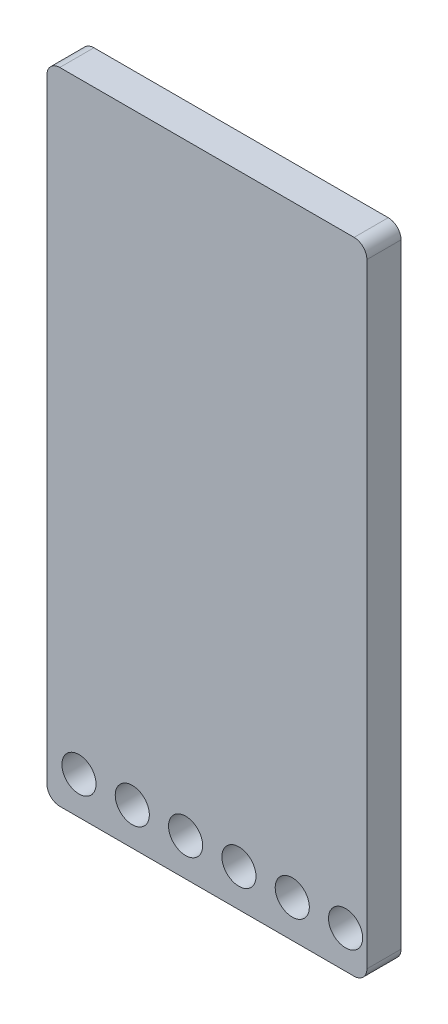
ISO-10303-21;
HEADER;
FILE_DESCRIPTION(('STEP AP214'),'2;1');
FILE_NAME('part.step','',(''),(''),'','','');
FILE_SCHEMA(('AUTOMOTIVE_DESIGN { 1 0 10303 214 1 1 1 1 }'));
ENDSEC;
DATA;
#1=APPLICATION_CONTEXT('core data for automotive mechanical design processes');
#2=APPLICATION_PROTOCOL_DEFINITION('international standard','automotive_design',2000,#1);
#3=PRODUCT_CONTEXT('',#1,'mechanical');
#4=PRODUCT('Part','Part','',(#3));
#5=PRODUCT_RELATED_PRODUCT_CATEGORY('part','',(#4));
#6=PRODUCT_DEFINITION_FORMATION('','',#4);
#7=PRODUCT_DEFINITION_CONTEXT('part definition',#1,'design');
#8=PRODUCT_DEFINITION('design','',#6,#7);
#9=PRODUCT_DEFINITION_SHAPE('','',#8);
#10=(LENGTH_UNIT() NAMED_UNIT(*) SI_UNIT(.MILLI.,.METRE.));
#11=(NAMED_UNIT(*) PLANE_ANGLE_UNIT() SI_UNIT($,.RADIAN.));
#12=(NAMED_UNIT(*) SI_UNIT($,.STERADIAN.) SOLID_ANGLE_UNIT());
#13=UNCERTAINTY_MEASURE_WITH_UNIT(LENGTH_MEASURE(1.E-05),#10,'distance_accuracy_value','');
#14=(GEOMETRIC_REPRESENTATION_CONTEXT(3) GLOBAL_UNCERTAINTY_ASSIGNED_CONTEXT((#13)) GLOBAL_UNIT_ASSIGNED_CONTEXT((#10,
#11,#12)) REPRESENTATION_CONTEXT('',''));
#15=CARTESIAN_POINT('',(0.,0.,0.));
#16=DIRECTION('',(0.,0.,1.));
#17=DIRECTION('',(1.,0.,0.));
#18=AXIS2_PLACEMENT_3D('',#15,#16,#17);
#19=CARTESIAN_POINT('',(6.9,-14.4,1.6));
#20=DIRECTION('',(0.,0.,-1.));
#21=DIRECTION('',(-1.,0.,0.));
#22=AXIS2_PLACEMENT_3D('',#19,#20,#21);
#23=CYLINDRICAL_SURFACE('',#22,0.6);
#24=CARTESIAN_POINT('',(6.9,-14.4,0.));
#25=DIRECTION('',(0.,0.,1.));
#26=DIRECTION('',(1.,0.,0.));
#27=AXIS2_PLACEMENT_3D('',#24,#25,#26);
#28=CIRCLE('',#27,0.6);
#29=CARTESIAN_POINT('',(6.9,-15.,0.));
#30=VERTEX_POINT('',#29);
#31=CARTESIAN_POINT('',(7.5,-14.4,0.));
#32=VERTEX_POINT('',#31);
#33=EDGE_CURVE('E139',#30,#32,#28,.T.);
#34=ORIENTED_EDGE('',*,*,#33,.T.);
#35=DIRECTION('',(0.,0.,-1.));
#36=VECTOR('',#35,1.);
#37=CARTESIAN_POINT('',(7.5,-14.4,1.6));
#38=LINE('',#37,#36);
#39=CARTESIAN_POINT('',(7.5,-14.4,1.6));
#40=VERTEX_POINT('',#39);
#41=EDGE_CURVE('E11',#40,#32,#38,.T.);
#42=ORIENTED_EDGE('',*,*,#41,.F.);
#43=CARTESIAN_POINT('',(6.9,-14.4,1.6));
#44=DIRECTION('',(0.,0.,1.));
#45=DIRECTION('',(1.,0.,0.));
#46=AXIS2_PLACEMENT_3D('',#43,#44,#45);
#47=CIRCLE('',#46,0.6);
#48=CARTESIAN_POINT('',(6.9,-15.,1.6));
#49=VERTEX_POINT('',#48);
#50=EDGE_CURVE('E162',#49,#40,#47,.T.);
#51=ORIENTED_EDGE('',*,*,#50,.F.);
#52=DIRECTION('',(0.,0.,-1.));
#53=VECTOR('',#52,1.);
#54=CARTESIAN_POINT('',(6.9,-15.,1.6));
#55=LINE('',#54,#53);
#56=EDGE_CURVE('E135',#49,#30,#55,.T.);
#57=ORIENTED_EDGE('',*,*,#56,.T.);
#58=EDGE_LOOP('',(#34,#42,#51,#57));
#59=FACE_BOUND('',#58,.T.);
#60=ADVANCED_FACE('F38',(#59),#23,.T.);
#61=CARTESIAN_POINT('',(7.5,-14.4,1.6));
#62=DIRECTION('',(-1.,0.,0.));
#63=DIRECTION('',(0.,0.,1.));
#64=AXIS2_PLACEMENT_3D('',#61,#62,#63);
#65=PLANE('',#64);
#66=DIRECTION('',(0.,1.,0.));
#67=VECTOR('',#66,1.);
#68=CARTESIAN_POINT('',(7.5,-14.4,0.));
#69=LINE('',#68,#67);
#70=CARTESIAN_POINT('',(7.5,14.4,0.));
#71=VERTEX_POINT('',#70);
#72=EDGE_CURVE('E143',#32,#71,#69,.T.);
#73=ORIENTED_EDGE('',*,*,#72,.T.);
#74=DIRECTION('',(0.,0.,-1.));
#75=VECTOR('',#74,1.);
#76=CARTESIAN_POINT('',(7.5,14.4,1.6));
#77=LINE('',#76,#75);
#78=CARTESIAN_POINT('',(7.5,14.4,1.6));
#79=VERTEX_POINT('',#78);
#80=EDGE_CURVE('E47',#79,#71,#77,.T.);
#81=ORIENTED_EDGE('',*,*,#80,.F.);
#82=DIRECTION('',(0.,1.,0.));
#83=VECTOR('',#82,1.);
#84=CARTESIAN_POINT('',(7.5,-14.4,1.6));
#85=LINE('',#84,#83);
#86=EDGE_CURVE('E98',#40,#79,#85,.T.);
#87=ORIENTED_EDGE('',*,*,#86,.F.);
#88=ORIENTED_EDGE('',*,*,#41,.T.);
#89=EDGE_LOOP('',(#73,#81,#87,#88));
#90=FACE_BOUND('',#89,.T.);
#91=ADVANCED_FACE('F291',(#90),#65,.F.);
#92=CARTESIAN_POINT('',(6.9,14.4,1.6));
#93=DIRECTION('',(0.,0.,-1.));
#94=DIRECTION('',(-1.,0.,0.));
#95=AXIS2_PLACEMENT_3D('',#92,#93,#94);
#96=CYLINDRICAL_SURFACE('',#95,0.6);
#97=CARTESIAN_POINT('',(6.9,14.4,0.));
#98=DIRECTION('',(0.,0.,1.));
#99=DIRECTION('',(-1.,0.,0.));
#100=AXIS2_PLACEMENT_3D('',#97,#98,#99);
#101=CIRCLE('',#100,0.6);
#102=CARTESIAN_POINT('',(6.9,15.,0.));
#103=VERTEX_POINT('',#102);
#104=EDGE_CURVE('E147',#71,#103,#101,.T.);
#105=ORIENTED_EDGE('',*,*,#104,.T.);
#106=DIRECTION('',(0.,0.,-1.));
#107=VECTOR('',#106,1.);
#108=CARTESIAN_POINT('',(6.9,15.,1.6));
#109=LINE('',#108,#107);
#110=CARTESIAN_POINT('',(6.9,15.,1.6));
#111=VERTEX_POINT('',#110);
#112=EDGE_CURVE('E173',#111,#103,#109,.T.);
#113=ORIENTED_EDGE('',*,*,#112,.F.);
#114=CARTESIAN_POINT('',(6.9,14.4,1.6));
#115=DIRECTION('',(0.,0.,1.));
#116=DIRECTION('',(-1.,0.,0.));
#117=AXIS2_PLACEMENT_3D('',#114,#115,#116);
#118=CIRCLE('',#117,0.6);
#119=EDGE_CURVE('E183',#79,#111,#118,.T.);
#120=ORIENTED_EDGE('',*,*,#119,.F.);
#121=ORIENTED_EDGE('',*,*,#80,.T.);
#122=EDGE_LOOP('',(#105,#113,#120,#121));
#123=FACE_BOUND('',#122,.T.);
#124=ADVANCED_FACE('F181',(#123),#96,.T.);
#125=CARTESIAN_POINT('',(-6.9,15.,1.6));
#126=DIRECTION('',(0.,-1.,0.));
#127=DIRECTION('',(0.,0.,-1.));
#128=AXIS2_PLACEMENT_3D('',#125,#126,#127);
#129=PLANE('',#128);
#130=DIRECTION('',(-1.,0.,0.));
#131=VECTOR('',#130,1.);
#132=CARTESIAN_POINT('',(-6.9,15.,0.));
#133=LINE('',#132,#131);
#134=CARTESIAN_POINT('',(-6.9,15.,0.));
#135=VERTEX_POINT('',#134);
#136=EDGE_CURVE('E150',#103,#135,#133,.T.);
#137=ORIENTED_EDGE('',*,*,#136,.T.);
#138=DIRECTION('',(0.,0.,-1.));
#139=VECTOR('',#138,1.);
#140=CARTESIAN_POINT('',(-6.9,15.,1.6));
#141=LINE('',#140,#139);
#142=CARTESIAN_POINT('',(-6.9,15.,1.6));
#143=VERTEX_POINT('',#142);
#144=EDGE_CURVE('E169',#143,#135,#141,.T.);
#145=ORIENTED_EDGE('',*,*,#144,.F.);
#146=DIRECTION('',(-1.,0.,0.));
#147=VECTOR('',#146,1.);
#148=CARTESIAN_POINT('',(-6.9,15.,1.6));
#149=LINE('',#148,#147);
#150=EDGE_CURVE('E196',#111,#143,#149,.T.);
#151=ORIENTED_EDGE('',*,*,#150,.F.);
#152=ORIENTED_EDGE('',*,*,#112,.T.);
#153=EDGE_LOOP('',(#137,#145,#151,#152));
#154=FACE_BOUND('',#153,.T.);
#155=ADVANCED_FACE('F191',(#154),#129,.F.);
#156=CARTESIAN_POINT('',(-6.9,14.4,1.6));
#157=DIRECTION('',(0.,0.,-1.));
#158=DIRECTION('',(-1.,0.,0.));
#159=AXIS2_PLACEMENT_3D('',#156,#157,#158);
#160=CYLINDRICAL_SURFACE('',#159,0.6);
#161=CARTESIAN_POINT('',(-6.9,14.4,0.));
#162=DIRECTION('',(0.,0.,1.));
#163=DIRECTION('',(-1.,0.,0.));
#164=AXIS2_PLACEMENT_3D('',#161,#162,#163);
#165=CIRCLE('',#164,0.6);
#166=CARTESIAN_POINT('',(-7.5,14.4,0.));
#167=VERTEX_POINT('',#166);
#168=EDGE_CURVE('E153',#135,#167,#165,.T.);
#169=ORIENTED_EDGE('',*,*,#168,.T.);
#170=DIRECTION('',(0.,0.,-1.));
#171=VECTOR('',#170,1.);
#172=CARTESIAN_POINT('',(-7.5,14.4,1.6));
#173=LINE('',#172,#171);
#174=CARTESIAN_POINT('',(-7.5,14.4,1.6));
#175=VERTEX_POINT('',#174);
#176=EDGE_CURVE('E128',#175,#167,#173,.T.);
#177=ORIENTED_EDGE('',*,*,#176,.F.);
#178=CARTESIAN_POINT('',(-6.9,14.4,1.6));
#179=DIRECTION('',(0.,0.,1.));
#180=DIRECTION('',(-1.,0.,0.));
#181=AXIS2_PLACEMENT_3D('',#178,#179,#180);
#182=CIRCLE('',#181,0.6);
#183=EDGE_CURVE('E117',#143,#175,#182,.T.);
#184=ORIENTED_EDGE('',*,*,#183,.F.);
#185=ORIENTED_EDGE('',*,*,#144,.T.);
#186=EDGE_LOOP('',(#169,#177,#184,#185));
#187=FACE_BOUND('',#186,.T.);
#188=ADVANCED_FACE('F194',(#187),#160,.T.);
#189=CARTESIAN_POINT('',(-7.5,-14.4,1.6));
#190=DIRECTION('',(1.,0.,0.));
#191=DIRECTION('',(0.,0.,-1.));
#192=AXIS2_PLACEMENT_3D('',#189,#190,#191);
#193=PLANE('',#192);
#194=DIRECTION('',(0.,-1.,0.));
#195=VECTOR('',#194,1.);
#196=CARTESIAN_POINT('',(-7.5,-14.4,0.));
#197=LINE('',#196,#195);
#198=CARTESIAN_POINT('',(-7.5,-14.4,0.));
#199=VERTEX_POINT('',#198);
#200=EDGE_CURVE('E126',#167,#199,#197,.T.);
#201=ORIENTED_EDGE('',*,*,#200,.T.);
#202=DIRECTION('',(0.,0.,-1.));
#203=VECTOR('',#202,1.);
#204=CARTESIAN_POINT('',(-7.5,-14.4,1.6));
#205=LINE('',#204,#203);
#206=CARTESIAN_POINT('',(-7.5,-14.4,1.6));
#207=VERTEX_POINT('',#206);
#208=EDGE_CURVE('E123',#207,#199,#205,.T.);
#209=ORIENTED_EDGE('',*,*,#208,.F.);
#210=DIRECTION('',(0.,-1.,0.));
#211=VECTOR('',#210,1.);
#212=CARTESIAN_POINT('',(-7.5,-14.4,1.6));
#213=LINE('',#212,#211);
#214=EDGE_CURVE('E111',#175,#207,#213,.T.);
#215=ORIENTED_EDGE('',*,*,#214,.F.);
#216=ORIENTED_EDGE('',*,*,#176,.T.);
#217=EDGE_LOOP('',(#201,#209,#215,#216));
#218=FACE_BOUND('',#217,.T.);
#219=ADVANCED_FACE('F124',(#218),#193,.F.);
#220=CARTESIAN_POINT('',(-6.9,-14.4,1.6));
#221=DIRECTION('',(0.,0.,-1.));
#222=DIRECTION('',(-1.,0.,0.));
#223=AXIS2_PLACEMENT_3D('',#220,#221,#222);
#224=CYLINDRICAL_SURFACE('',#223,0.6);
#225=CARTESIAN_POINT('',(-6.9,-14.4,0.));
#226=DIRECTION('',(0.,0.,1.));
#227=DIRECTION('',(-1.,0.,0.));
#228=AXIS2_PLACEMENT_3D('',#225,#226,#227);
#229=CIRCLE('',#228,0.6);
#230=CARTESIAN_POINT('',(-6.9,-15.,0.));
#231=VERTEX_POINT('',#230);
#232=EDGE_CURVE('E84',#199,#231,#229,.T.);
#233=ORIENTED_EDGE('',*,*,#232,.T.);
#234=DIRECTION('',(0.,0.,-1.));
#235=VECTOR('',#234,1.);
#236=CARTESIAN_POINT('',(-6.9,-15.,1.6));
#237=LINE('',#236,#235);
#238=CARTESIAN_POINT('',(-6.9,-15.,1.6));
#239=VERTEX_POINT('',#238);
#240=EDGE_CURVE('E129',#239,#231,#237,.T.);
#241=ORIENTED_EDGE('',*,*,#240,.F.);
#242=CARTESIAN_POINT('',(-6.9,-14.4,1.6));
#243=DIRECTION('',(0.,0.,1.));
#244=DIRECTION('',(-1.,0.,0.));
#245=AXIS2_PLACEMENT_3D('',#242,#243,#244);
#246=CIRCLE('',#245,0.6);
#247=EDGE_CURVE('E115',#207,#239,#246,.T.);
#248=ORIENTED_EDGE('',*,*,#247,.F.);
#249=ORIENTED_EDGE('',*,*,#208,.T.);
#250=EDGE_LOOP('',(#233,#241,#248,#249));
#251=FACE_BOUND('',#250,.T.);
#252=ADVANCED_FACE('F131',(#251),#224,.T.);
#253=CARTESIAN_POINT('',(-6.9,-15.,1.6));
#254=DIRECTION('',(0.,1.,0.));
#255=DIRECTION('',(0.,0.,1.));
#256=AXIS2_PLACEMENT_3D('',#253,#254,#255);
#257=PLANE('',#256);
#258=DIRECTION('',(1.,0.,0.));
#259=VECTOR('',#258,1.);
#260=CARTESIAN_POINT('',(-6.9,-15.,0.));
#261=LINE('',#260,#259);
#262=EDGE_CURVE('E90',#231,#30,#261,.T.);
#263=ORIENTED_EDGE('',*,*,#262,.T.);
#264=ORIENTED_EDGE('',*,*,#56,.F.);
#265=DIRECTION('',(1.,0.,0.));
#266=VECTOR('',#265,1.);
#267=CARTESIAN_POINT('',(-6.9,-15.,1.6));
#268=LINE('',#267,#266);
#269=EDGE_CURVE('E55',#239,#49,#268,.T.);
#270=ORIENTED_EDGE('',*,*,#269,.F.);
#271=ORIENTED_EDGE('',*,*,#240,.T.);
#272=EDGE_LOOP('',(#263,#264,#270,#271));
#273=FACE_BOUND('',#272,.T.);
#274=ADVANCED_FACE('F298',(#273),#257,.F.);
#275=CARTESIAN_POINT('',(6.9,-14.4,1.6));
#276=DIRECTION('',(0.,0.,1.));
#277=DIRECTION('',(1.,0.,0.));
#278=AXIS2_PLACEMENT_3D('',#275,#276,#277);
#279=PLANE('',#278);
#280=CARTESIAN_POINT('',(6.5,-13.247254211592,1.6));
#281=DIRECTION('',(0.,0.,-1.));
#282=DIRECTION('',(-1.,0.,0.));
#283=AXIS2_PLACEMENT_3D('',#280,#281,#282);
#284=CIRCLE('',#283,0.800000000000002);
#285=CARTESIAN_POINT('',(5.7,-13.247254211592,1.6));
#286=VERTEX_POINT('',#285);
#287=EDGE_CURVE('E144',#286,#286,#284,.T.);
#288=ORIENTED_EDGE('',*,*,#287,.T.);
#289=EDGE_LOOP('',(#288));
#290=FACE_BOUND('',#289,.T.);
#291=CARTESIAN_POINT('',(4.,-13.247254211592,1.6));
#292=DIRECTION('',(0.,0.,-1.));
#293=DIRECTION('',(-1.,0.,0.));
#294=AXIS2_PLACEMENT_3D('',#291,#292,#293);
#295=CIRCLE('',#294,0.800000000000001);
#296=CARTESIAN_POINT('',(3.2,-13.247254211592,1.6));
#297=VERTEX_POINT('',#296);
#298=EDGE_CURVE('E242',#297,#297,#295,.T.);
#299=ORIENTED_EDGE('',*,*,#298,.T.);
#300=EDGE_LOOP('',(#299));
#301=FACE_BOUND('',#300,.T.);
#302=CARTESIAN_POINT('',(1.5,-13.247254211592,1.6));
#303=DIRECTION('',(0.,0.,-1.));
#304=DIRECTION('',(-1.,0.,0.));
#305=AXIS2_PLACEMENT_3D('',#302,#303,#304);
#306=CIRCLE('',#305,0.800000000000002);
#307=CARTESIAN_POINT('',(0.699999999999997,-13.247254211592,1.6));
#308=VERTEX_POINT('',#307);
#309=EDGE_CURVE('E234',#308,#308,#306,.T.);
#310=ORIENTED_EDGE('',*,*,#309,.T.);
#311=EDGE_LOOP('',(#310));
#312=FACE_BOUND('',#311,.T.);
#313=CARTESIAN_POINT('',(-1.,-13.247254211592,1.6));
#314=DIRECTION('',(0.,0.,-1.));
#315=DIRECTION('',(-1.,0.,0.));
#316=AXIS2_PLACEMENT_3D('',#313,#314,#315);
#317=CIRCLE('',#316,0.800000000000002);
#318=CARTESIAN_POINT('',(-1.8,-13.247254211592,1.6));
#319=VERTEX_POINT('',#318);
#320=EDGE_CURVE('E226',#319,#319,#317,.T.);
#321=ORIENTED_EDGE('',*,*,#320,.T.);
#322=EDGE_LOOP('',(#321));
#323=FACE_BOUND('',#322,.T.);
#324=CARTESIAN_POINT('',(-3.5,-13.247254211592,1.6));
#325=DIRECTION('',(0.,0.,-1.));
#326=DIRECTION('',(-1.,0.,0.));
#327=AXIS2_PLACEMENT_3D('',#324,#325,#326);
#328=CIRCLE('',#327,0.800000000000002);
#329=CARTESIAN_POINT('',(-4.3,-13.247254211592,1.6));
#330=VERTEX_POINT('',#329);
#331=EDGE_CURVE('E218',#330,#330,#328,.T.);
#332=ORIENTED_EDGE('',*,*,#331,.T.);
#333=EDGE_LOOP('',(#332));
#334=FACE_BOUND('',#333,.T.);
#335=CARTESIAN_POINT('',(-6.,-13.247254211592,1.6));
#336=DIRECTION('',(0.,0.,-1.));
#337=DIRECTION('',(-1.,0.,0.));
#338=AXIS2_PLACEMENT_3D('',#335,#336,#337);
#339=CIRCLE('',#338,0.800000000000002);
#340=CARTESIAN_POINT('',(-6.8,-13.247254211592,1.6));
#341=VERTEX_POINT('',#340);
#342=EDGE_CURVE('E210',#341,#341,#339,.T.);
#343=ORIENTED_EDGE('',*,*,#342,.T.);
#344=EDGE_LOOP('',(#343));
#345=FACE_BOUND('',#344,.T.);
#346=ORIENTED_EDGE('',*,*,#50,.T.);
#347=ORIENTED_EDGE('',*,*,#86,.T.);
#348=ORIENTED_EDGE('',*,*,#119,.T.);
#349=ORIENTED_EDGE('',*,*,#150,.T.);
#350=ORIENTED_EDGE('',*,*,#183,.T.);
#351=ORIENTED_EDGE('',*,*,#214,.T.);
#352=ORIENTED_EDGE('',*,*,#247,.T.);
#353=ORIENTED_EDGE('',*,*,#269,.T.);
#354=EDGE_LOOP('',(#346,#347,#348,#349,#350,#351,#352,#353));
#355=FACE_BOUND('',#354,.T.);
#356=ADVANCED_FACE('F113',(#290,#301,#312,#323,#334,#345,#355),#279,.T.);
#357=CARTESIAN_POINT('',(6.9,-14.4,0.));
#358=DIRECTION('',(0.,0.,1.));
#359=DIRECTION('',(1.,0.,0.));
#360=AXIS2_PLACEMENT_3D('',#357,#358,#359);
#361=PLANE('',#360);
#362=CARTESIAN_POINT('',(6.5,-13.247254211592,0.));
#363=DIRECTION('',(0.,0.,-1.));
#364=DIRECTION('',(-1.,0.,0.));
#365=AXIS2_PLACEMENT_3D('',#362,#363,#364);
#366=CIRCLE('',#365,0.800000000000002);
#367=CARTESIAN_POINT('',(5.7,-13.247254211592,0.));
#368=VERTEX_POINT('',#367);
#369=EDGE_CURVE('E246',#368,#368,#366,.T.);
#370=ORIENTED_EDGE('',*,*,#369,.F.);
#371=EDGE_LOOP('',(#370));
#372=FACE_BOUND('',#371,.T.);
#373=CARTESIAN_POINT('',(4.,-13.247254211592,0.));
#374=DIRECTION('',(0.,0.,-1.));
#375=DIRECTION('',(-1.,0.,0.));
#376=AXIS2_PLACEMENT_3D('',#373,#374,#375);
#377=CIRCLE('',#376,0.800000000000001);
#378=CARTESIAN_POINT('',(3.2,-13.247254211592,0.));
#379=VERTEX_POINT('',#378);
#380=EDGE_CURVE('E238',#379,#379,#377,.T.);
#381=ORIENTED_EDGE('',*,*,#380,.F.);
#382=EDGE_LOOP('',(#381));
#383=FACE_BOUND('',#382,.T.);
#384=CARTESIAN_POINT('',(1.5,-13.247254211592,0.));
#385=DIRECTION('',(0.,0.,-1.));
#386=DIRECTION('',(-1.,0.,0.));
#387=AXIS2_PLACEMENT_3D('',#384,#385,#386);
#388=CIRCLE('',#387,0.800000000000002);
#389=CARTESIAN_POINT('',(0.699999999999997,-13.247254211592,0.));
#390=VERTEX_POINT('',#389);
#391=EDGE_CURVE('E230',#390,#390,#388,.T.);
#392=ORIENTED_EDGE('',*,*,#391,.F.);
#393=EDGE_LOOP('',(#392));
#394=FACE_BOUND('',#393,.T.);
#395=CARTESIAN_POINT('',(-1.,-13.247254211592,0.));
#396=DIRECTION('',(0.,0.,-1.));
#397=DIRECTION('',(-1.,0.,0.));
#398=AXIS2_PLACEMENT_3D('',#395,#396,#397);
#399=CIRCLE('',#398,0.800000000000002);
#400=CARTESIAN_POINT('',(-1.8,-13.247254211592,0.));
#401=VERTEX_POINT('',#400);
#402=EDGE_CURVE('E222',#401,#401,#399,.T.);
#403=ORIENTED_EDGE('',*,*,#402,.F.);
#404=EDGE_LOOP('',(#403));
#405=FACE_BOUND('',#404,.T.);
#406=CARTESIAN_POINT('',(-3.5,-13.247254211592,0.));
#407=DIRECTION('',(0.,0.,-1.));
#408=DIRECTION('',(-1.,0.,0.));
#409=AXIS2_PLACEMENT_3D('',#406,#407,#408);
#410=CIRCLE('',#409,0.800000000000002);
#411=CARTESIAN_POINT('',(-4.3,-13.247254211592,0.));
#412=VERTEX_POINT('',#411);
#413=EDGE_CURVE('E214',#412,#412,#410,.T.);
#414=ORIENTED_EDGE('',*,*,#413,.F.);
#415=EDGE_LOOP('',(#414));
#416=FACE_BOUND('',#415,.T.);
#417=CARTESIAN_POINT('',(-6.,-13.247254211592,0.));
#418=DIRECTION('',(0.,0.,-1.));
#419=DIRECTION('',(-1.,0.,0.));
#420=AXIS2_PLACEMENT_3D('',#417,#418,#419);
#421=CIRCLE('',#420,0.800000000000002);
#422=CARTESIAN_POINT('',(-6.8,-13.247254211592,0.));
#423=VERTEX_POINT('',#422);
#424=EDGE_CURVE('E206',#423,#423,#421,.T.);
#425=ORIENTED_EDGE('',*,*,#424,.F.);
#426=EDGE_LOOP('',(#425));
#427=FACE_BOUND('',#426,.T.);
#428=ORIENTED_EDGE('',*,*,#33,.F.);
#429=ORIENTED_EDGE('',*,*,#262,.F.);
#430=ORIENTED_EDGE('',*,*,#232,.F.);
#431=ORIENTED_EDGE('',*,*,#200,.F.);
#432=ORIENTED_EDGE('',*,*,#168,.F.);
#433=ORIENTED_EDGE('',*,*,#136,.F.);
#434=ORIENTED_EDGE('',*,*,#104,.F.);
#435=ORIENTED_EDGE('',*,*,#72,.F.);
#436=EDGE_LOOP('',(#428,#429,#430,#431,#432,#433,#434,#435));
#437=FACE_BOUND('',#436,.T.);
#438=ADVANCED_FACE('F187',(#372,#383,#394,#405,#416,#427,#437),#361,.F.);
#439=CARTESIAN_POINT('',(-6.,-13.247254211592,1.6));
#440=DIRECTION('',(0.,0.,-1.));
#441=DIRECTION('',(-1.,0.,0.));
#442=AXIS2_PLACEMENT_3D('',#439,#440,#441);
#443=CYLINDRICAL_SURFACE('',#442,0.800000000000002);
#444=ORIENTED_EDGE('',*,*,#342,.F.);
#445=EDGE_LOOP('',(#444));
#446=FACE_BOUND('',#445,.T.);
#447=ORIENTED_EDGE('',*,*,#424,.T.);
#448=EDGE_LOOP('',(#447));
#449=FACE_BOUND('',#448,.T.);
#450=ADVANCED_FACE('F265',(#446,#449),#443,.F.);
#451=CARTESIAN_POINT('',(-3.5,-13.247254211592,1.6));
#452=DIRECTION('',(0.,0.,-1.));
#453=DIRECTION('',(-1.,0.,0.));
#454=AXIS2_PLACEMENT_3D('',#451,#452,#453);
#455=CYLINDRICAL_SURFACE('',#454,0.800000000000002);
#456=ORIENTED_EDGE('',*,*,#331,.F.);
#457=EDGE_LOOP('',(#456));
#458=FACE_BOUND('',#457,.T.);
#459=ORIENTED_EDGE('',*,*,#413,.T.);
#460=EDGE_LOOP('',(#459));
#461=FACE_BOUND('',#460,.T.);
#462=ADVANCED_FACE('F278',(#458,#461),#455,.F.);
#463=CARTESIAN_POINT('',(-1.,-13.247254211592,1.6));
#464=DIRECTION('',(0.,0.,-1.));
#465=DIRECTION('',(-1.,0.,0.));
#466=AXIS2_PLACEMENT_3D('',#463,#464,#465);
#467=CYLINDRICAL_SURFACE('',#466,0.800000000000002);
#468=ORIENTED_EDGE('',*,*,#320,.F.);
#469=EDGE_LOOP('',(#468));
#470=FACE_BOUND('',#469,.T.);
#471=ORIENTED_EDGE('',*,*,#402,.T.);
#472=EDGE_LOOP('',(#471));
#473=FACE_BOUND('',#472,.T.);
#474=ADVANCED_FACE('F285',(#470,#473),#467,.F.);
#475=CARTESIAN_POINT('',(1.5,-13.247254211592,1.6));
#476=DIRECTION('',(0.,0.,-1.));
#477=DIRECTION('',(-1.,0.,0.));
#478=AXIS2_PLACEMENT_3D('',#475,#476,#477);
#479=CYLINDRICAL_SURFACE('',#478,0.800000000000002);
#480=ORIENTED_EDGE('',*,*,#309,.F.);
#481=EDGE_LOOP('',(#480));
#482=FACE_BOUND('',#481,.T.);
#483=ORIENTED_EDGE('',*,*,#391,.T.);
#484=EDGE_LOOP('',(#483));
#485=FACE_BOUND('',#484,.T.);
#486=ADVANCED_FACE('F364',(#482,#485),#479,.F.);
#487=CARTESIAN_POINT('',(4.,-13.247254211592,1.6));
#488=DIRECTION('',(0.,0.,-1.));
#489=DIRECTION('',(-1.,0.,0.));
#490=AXIS2_PLACEMENT_3D('',#487,#488,#489);
#491=CYLINDRICAL_SURFACE('',#490,0.800000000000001);
#492=ORIENTED_EDGE('',*,*,#298,.F.);
#493=EDGE_LOOP('',(#492));
#494=FACE_BOUND('',#493,.T.);
#495=ORIENTED_EDGE('',*,*,#380,.T.);
#496=EDGE_LOOP('',(#495));
#497=FACE_BOUND('',#496,.T.);
#498=ADVANCED_FACE('F259',(#494,#497),#491,.F.);
#499=CARTESIAN_POINT('',(6.5,-13.247254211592,1.6));
#500=DIRECTION('',(0.,0.,-1.));
#501=DIRECTION('',(-1.,0.,0.));
#502=AXIS2_PLACEMENT_3D('',#499,#500,#501);
#503=CYLINDRICAL_SURFACE('',#502,0.800000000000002);
#504=ORIENTED_EDGE('',*,*,#287,.F.);
#505=EDGE_LOOP('',(#504));
#506=FACE_BOUND('',#505,.T.);
#507=ORIENTED_EDGE('',*,*,#369,.T.);
#508=EDGE_LOOP('',(#507));
#509=FACE_BOUND('',#508,.T.);
#510=ADVANCED_FACE('F256',(#506,#509),#503,.F.);
#511=CLOSED_SHELL('',(#60,#91,#124,#155,#188,#219,#252,#274,#356,#438,#450,#462,#474,#486,#498,#510));
#512=MANIFOLD_SOLID_BREP('B2',#511);
#513=ADVANCED_BREP_SHAPE_REPRESENTATION('',(#18,#512),#14);
#514=SHAPE_DEFINITION_REPRESENTATION(#9,#513);
ENDSEC;
END-ISO-10303-21;
